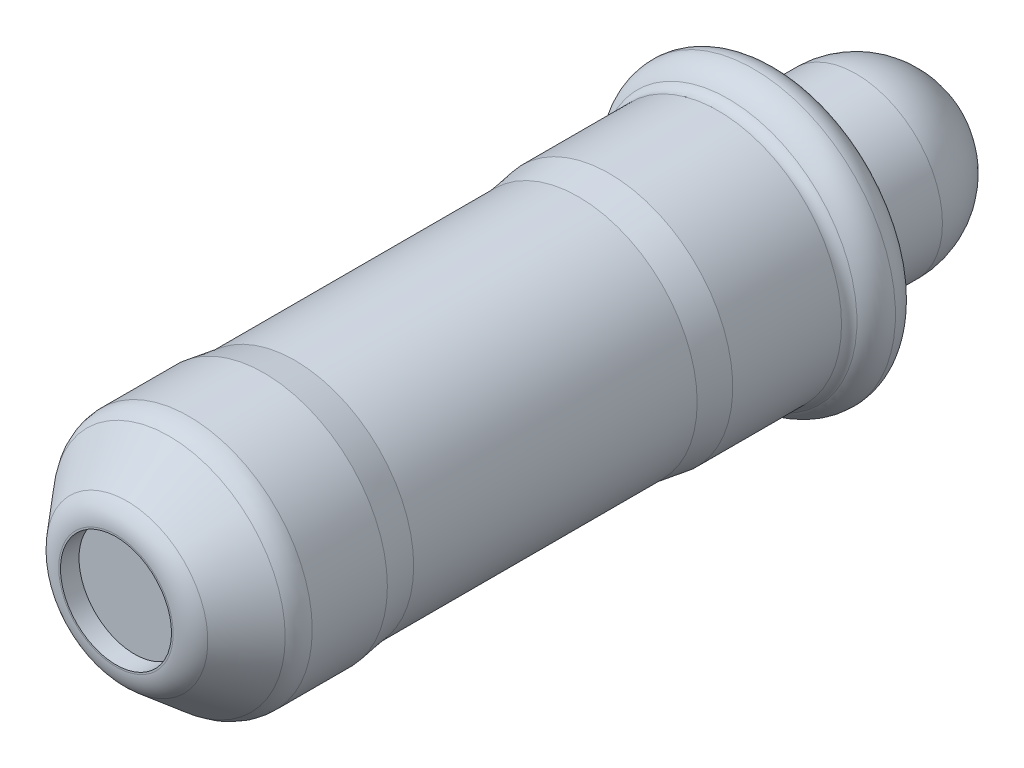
ISO-10303-21;
HEADER;
FILE_DESCRIPTION(('STEP AP214'),'2;1');
FILE_NAME('part.step','',(''),(''),'','','');
FILE_SCHEMA(('AUTOMOTIVE_DESIGN { 1 0 10303 214 1 1 1 1 }'));
ENDSEC;
DATA;
#1=APPLICATION_CONTEXT('core data for automotive mechanical design processes');
#2=APPLICATION_PROTOCOL_DEFINITION('international standard','automotive_design',2000,#1);
#3=PRODUCT_CONTEXT('',#1,'mechanical');
#4=PRODUCT('Part','Part','',(#3));
#5=PRODUCT_RELATED_PRODUCT_CATEGORY('part','',(#4));
#6=PRODUCT_DEFINITION_FORMATION('','',#4);
#7=PRODUCT_DEFINITION_CONTEXT('part definition',#1,'design');
#8=PRODUCT_DEFINITION('design','',#6,#7);
#9=PRODUCT_DEFINITION_SHAPE('','',#8);
#10=(LENGTH_UNIT() NAMED_UNIT(*) SI_UNIT(.MILLI.,.METRE.));
#11=(NAMED_UNIT(*) PLANE_ANGLE_UNIT() SI_UNIT($,.RADIAN.));
#12=(NAMED_UNIT(*) SI_UNIT($,.STERADIAN.) SOLID_ANGLE_UNIT());
#13=UNCERTAINTY_MEASURE_WITH_UNIT(LENGTH_MEASURE(1.E-05),#10,'distance_accuracy_value','');
#14=(GEOMETRIC_REPRESENTATION_CONTEXT(3) GLOBAL_UNCERTAINTY_ASSIGNED_CONTEXT((#13)) GLOBAL_UNIT_ASSIGNED_CONTEXT((#10,
#11,#12)) REPRESENTATION_CONTEXT('',''));
#15=CARTESIAN_POINT('',(0.,0.,0.));
#16=DIRECTION('',(0.,0.,1.));
#17=DIRECTION('',(1.,0.,0.));
#18=AXIS2_PLACEMENT_3D('',#15,#16,#17);
#19=CARTESIAN_POINT('',(0.,0.,2.7));
#20=DIRECTION('',(0.,0.,1.));
#21=DIRECTION('',(1.,0.,0.));
#22=AXIS2_PLACEMENT_3D('',#19,#20,#21);
#23=CYLINDRICAL_SURFACE('',#22,0.9);
#24=CARTESIAN_POINT('',(0.,0.,13.4));
#25=DIRECTION('',(0.,0.,1.));
#26=DIRECTION('',(1.,0.,0.));
#27=AXIS2_PLACEMENT_3D('',#24,#25,#26);
#28=CIRCLE('',#27,0.9);
#29=CARTESIAN_POINT('',(0.9,0.,13.4));
#30=VERTEX_POINT('',#29);
#31=EDGE_CURVE('E154',#30,#30,#28,.F.);
#32=ORIENTED_EDGE('',*,*,#31,.F.);
#33=EDGE_LOOP('',(#32));
#34=FACE_BOUND('',#33,.T.);
#35=CARTESIAN_POINT('',(0.,0.,13.1));
#36=DIRECTION('',(0.,0.,1.));
#37=DIRECTION('',(1.,0.,0.));
#38=AXIS2_PLACEMENT_3D('',#35,#36,#37);
#39=CIRCLE('',#38,0.9);
#40=CARTESIAN_POINT('',(0.9,0.,13.1));
#41=VERTEX_POINT('',#40);
#42=EDGE_CURVE('E161',#41,#41,#39,.T.);
#43=ORIENTED_EDGE('',*,*,#42,.F.);
#44=EDGE_LOOP('',(#43));
#45=FACE_BOUND('',#44,.T.);
#46=ADVANCED_FACE('F12',(#34,#45),#23,.F.);
#47=CARTESIAN_POINT('',(0.,1.39,2.7));
#48=DIRECTION('',(0.,0.,-1.));
#49=DIRECTION('',(-1.,0.,0.));
#50=AXIS2_PLACEMENT_3D('',#47,#48,#49);
#51=PLANE('',#50);
#52=CARTESIAN_POINT('',(0.,0.,2.7));
#53=DIRECTION('',(0.,0.,-1.));
#54=DIRECTION('',(-1.,0.,0.));
#55=AXIS2_PLACEMENT_3D('',#52,#53,#54);
#56=CIRCLE('',#55,1.4);
#57=CARTESIAN_POINT('',(-1.4,0.,2.7));
#58=VERTEX_POINT('',#57);
#59=EDGE_CURVE('E15',#58,#58,#56,.F.);
#60=ORIENTED_EDGE('',*,*,#59,.T.);
#61=EDGE_LOOP('',(#60));
#62=FACE_BOUND('',#61,.T.);
#63=CARTESIAN_POINT('',(0.,0.,2.70000000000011));
#64=DIRECTION('',(0.,0.,1.));
#65=DIRECTION('',(-1.,0.,0.));
#66=AXIS2_PLACEMENT_3D('',#63,#64,#65);
#67=CIRCLE('',#66,2.03326654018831);
#68=CARTESIAN_POINT('',(-2.03326654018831,0.,2.70000000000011));
#69=VERTEX_POINT('',#68);
#70=EDGE_CURVE('E150',#69,#69,#67,.T.);
#71=ORIENTED_EDGE('',*,*,#70,.F.);
#72=EDGE_LOOP('',(#71));
#73=FACE_BOUND('',#72,.T.);
#74=ADVANCED_FACE('F132',(#62,#73),#51,.T.);
#75=CARTESIAN_POINT('',(0.,0.927746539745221,13.4));
#76=DIRECTION('',(0.,0.,1.));
#77=DIRECTION('',(1.,0.,0.));
#78=AXIS2_PLACEMENT_3D('',#75,#76,#77);
#79=PLANE('',#78);
#80=CARTESIAN_POINT('',(0.,0.,13.4));
#81=DIRECTION('',(0.,0.,-1.));
#82=DIRECTION('',(-1.,0.,0.));
#83=AXIS2_PLACEMENT_3D('',#80,#81,#82);
#84=CIRCLE('',#83,0.927746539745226);
#85=CARTESIAN_POINT('',(-0.927746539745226,0.,13.4));
#86=VERTEX_POINT('',#85);
#87=EDGE_CURVE('E120',#86,#86,#84,.T.);
#88=ORIENTED_EDGE('',*,*,#87,.F.);
#89=EDGE_LOOP('',(#88));
#90=FACE_BOUND('',#89,.T.);
#91=ORIENTED_EDGE('',*,*,#31,.T.);
#92=EDGE_LOOP('',(#91));
#93=FACE_BOUND('',#92,.T.);
#94=ADVANCED_FACE('F124',(#90,#93),#79,.T.);
#95=CARTESIAN_POINT('',(0.,0.,2.9));
#96=DIRECTION('',(0.,0.,-1.));
#97=DIRECTION('',(-1.,0.,0.));
#98=AXIS2_PLACEMENT_3D('',#95,#96,#97);
#99=TOROIDAL_SURFACE('',#98,2.03326671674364,0.199999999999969);
#100=ORIENTED_EDGE('',*,*,#70,.T.);
#101=EDGE_LOOP('',(#100));
#102=FACE_BOUND('',#101,.T.);
#103=CARTESIAN_POINT('',(0.,0.,2.7589999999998));
#104=DIRECTION('',(0.,0.,-1.));
#105=DIRECTION('',(-1.,0.,0.));
#106=AXIS2_PLACEMENT_3D('',#103,#104,#105);
#107=CIRCLE('',#106,2.17510817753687);
#108=CARTESIAN_POINT('',(-2.17510817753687,0.,2.7589999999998));
#109=VERTEX_POINT('',#108);
#110=EDGE_CURVE('E89',#109,#109,#107,.F.);
#111=ORIENTED_EDGE('',*,*,#110,.F.);
#112=EDGE_LOOP('',(#111));
#113=FACE_BOUND('',#112,.T.);
#114=ADVANCED_FACE('F106',(#102,#113),#99,.T.);
#115=CARTESIAN_POINT('',(0.,0.,12.9));
#116=DIRECTION('',(0.,0.,-1.));
#117=DIRECTION('',(-1.,0.,0.));
#118=AXIS2_PLACEMENT_3D('',#115,#116,#117);
#119=TOROIDAL_SURFACE('',#118,0.927746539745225,0.5);
#120=CARTESIAN_POINT('',(0.,0.,13.2213938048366));
#121=DIRECTION('',(0.,0.,-1.));
#122=DIRECTION('',(-1.,0.,0.));
#123=AXIS2_PLACEMENT_3D('',#120,#121,#122);
#124=CIRCLE('',#123,1.31076876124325);
#125=CARTESIAN_POINT('',(-1.31076876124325,0.,13.2213938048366));
#126=VERTEX_POINT('',#125);
#127=EDGE_CURVE('E84',#126,#126,#124,.T.);
#128=ORIENTED_EDGE('',*,*,#127,.F.);
#129=EDGE_LOOP('',(#128));
#130=FACE_BOUND('',#129,.T.);
#131=ORIENTED_EDGE('',*,*,#87,.T.);
#132=EDGE_LOOP('',(#131));
#133=FACE_BOUND('',#132,.T.);
#134=ADVANCED_FACE('F100',(#130,#133),#119,.T.);
#135=CARTESIAN_POINT('',(0.,0.,3.062));
#136=DIRECTION('',(0.,0.,-1.));
#137=DIRECTION('',(-1.,0.,0.));
#138=AXIS2_PLACEMENT_3D('',#135,#136,#137);
#139=TOROIDAL_SURFACE('',#138,1.87,0.43);
#140=ORIENTED_EDGE('',*,*,#110,.T.);
#141=EDGE_LOOP('',(#140));
#142=FACE_BOUND('',#141,.T.);
#143=CARTESIAN_POINT('',(0.,0.,3.062));
#144=DIRECTION('',(0.,0.,-1.));
#145=DIRECTION('',(-1.,0.,0.));
#146=AXIS2_PLACEMENT_3D('',#143,#144,#145);
#147=CIRCLE('',#146,2.3);
#148=CARTESIAN_POINT('',(-2.3,0.,3.062));
#149=VERTEX_POINT('',#148);
#150=EDGE_CURVE('E78',#149,#149,#147,.F.);
#151=ORIENTED_EDGE('',*,*,#150,.F.);
#152=EDGE_LOOP('',(#151));
#153=FACE_BOUND('',#152,.T.);
#154=ADVANCED_FACE('F96',(#142,#153),#139,.T.);
#155=CARTESIAN_POINT('',(0.,0.,12.5394086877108));
#156=DIRECTION('',(0.,0.,-1.));
#157=DIRECTION('',(0.,1.,0.));
#158=AXIS2_PLACEMENT_3D('',#155,#156,#157);
#159=CONICAL_SURFACE('',#158,1.88302222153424,0.698131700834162);
#160=CARTESIAN_POINT('',(0.,0.,12.5394086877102));
#161=DIRECTION('',(0.,0.,-1.));
#162=DIRECTION('',(-1.,0.,0.));
#163=AXIS2_PLACEMENT_3D('',#160,#161,#162);
#164=CIRCLE('',#163,1.88302222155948);
#165=CARTESIAN_POINT('',(-1.88302222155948,0.,12.5394086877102));
#166=VERTEX_POINT('',#165);
#167=EDGE_CURVE('E75',#166,#166,#164,.T.);
#168=ORIENTED_EDGE('',*,*,#167,.F.);
#169=EDGE_LOOP('',(#168));
#170=FACE_BOUND('',#169,.T.);
#171=ORIENTED_EDGE('',*,*,#127,.T.);
#172=EDGE_LOOP('',(#171));
#173=FACE_BOUND('',#172,.T.);
#174=ADVANCED_FACE('F99',(#170,#173),#159,.T.);
#175=CARTESIAN_POINT('',(0.,0.,3.062));
#176=DIRECTION('',(0.,0.,-1.));
#177=DIRECTION('',(-1.,0.,0.));
#178=AXIS2_PLACEMENT_3D('',#175,#176,#177);
#179=TOROIDAL_SURFACE('',#178,1.8,0.500000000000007);
#180=ORIENTED_EDGE('',*,*,#150,.T.);
#181=EDGE_LOOP('',(#180));
#182=FACE_BOUND('',#181,.T.);
#183=CARTESIAN_POINT('',(0.,0.,3.47232590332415));
#184=DIRECTION('',(0.,0.,-1.));
#185=DIRECTION('',(-1.,0.,0.));
#186=AXIS2_PLACEMENT_3D('',#183,#184,#185);
#187=CIRCLE('',#186,2.08571428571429);
#188=CARTESIAN_POINT('',(-2.08571428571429,0.,3.47232590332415));
#189=VERTEX_POINT('',#188);
#190=EDGE_CURVE('E50',#189,#189,#187,.T.);
#191=ORIENTED_EDGE('',*,*,#190,.T.);
#192=EDGE_LOOP('',(#191));
#193=FACE_BOUND('',#192,.T.);
#194=ADVANCED_FACE('F68',(#182,#193),#179,.T.);
#195=CARTESIAN_POINT('',(0.,0.,12.2180148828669));
#196=DIRECTION('',(0.,0.,-1.));
#197=DIRECTION('',(-1.,0.,0.));
#198=AXIS2_PLACEMENT_3D('',#195,#196,#197);
#199=TOROIDAL_SURFACE('',#198,1.5,0.5);
#200=CARTESIAN_POINT('',(0.,0.,12.2180148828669));
#201=DIRECTION('',(0.,0.,1.));
#202=DIRECTION('',(1.,0.,0.));
#203=AXIS2_PLACEMENT_3D('',#200,#201,#202);
#204=CIRCLE('',#203,2.);
#205=CARTESIAN_POINT('',(2.,0.,12.2180148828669));
#206=VERTEX_POINT('',#205);
#207=EDGE_CURVE('E45',#206,#206,#204,.F.);
#208=ORIENTED_EDGE('',*,*,#207,.F.);
#209=EDGE_LOOP('',(#208));
#210=FACE_BOUND('',#209,.T.);
#211=ORIENTED_EDGE('',*,*,#167,.T.);
#212=EDGE_LOOP('',(#211));
#213=FACE_BOUND('',#212,.T.);
#214=ADVANCED_FACE('F62',(#210,#213),#199,.T.);
#215=CARTESIAN_POINT('',(0.,0.,3.6364562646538));
#216=DIRECTION('',(0.,0.,-1.));
#217=DIRECTION('',(-1.,0.,0.));
#218=AXIS2_PLACEMENT_3D('',#215,#216,#217);
#219=TOROIDAL_SURFACE('',#218,2.2,0.199999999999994);
#220=CARTESIAN_POINT('',(0.,0.,3.6364562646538));
#221=DIRECTION('',(0.,0.,1.));
#222=DIRECTION('',(1.,0.,0.));
#223=AXIS2_PLACEMENT_3D('',#220,#221,#222);
#224=CIRCLE('',#223,2.);
#225=CARTESIAN_POINT('',(2.,0.,3.6364562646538));
#226=VERTEX_POINT('',#225);
#227=EDGE_CURVE('E40',#226,#226,#224,.T.);
#228=ORIENTED_EDGE('',*,*,#227,.F.);
#229=EDGE_LOOP('',(#228));
#230=FACE_BOUND('',#229,.T.);
#231=ORIENTED_EDGE('',*,*,#190,.F.);
#232=EDGE_LOOP('',(#231));
#233=FACE_BOUND('',#232,.T.);
#234=ADVANCED_FACE('F57',(#230,#233),#219,.F.);
#235=CARTESIAN_POINT('',(0.,0.,2.7));
#236=DIRECTION('',(0.,0.,1.));
#237=DIRECTION('',(1.,0.,0.));
#238=AXIS2_PLACEMENT_3D('',#235,#236,#237);
#239=CYLINDRICAL_SURFACE('',#238,2.);
#240=CARTESIAN_POINT('',(0.,0.,10.9999999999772));
#241=DIRECTION('',(0.,0.,1.));
#242=DIRECTION('',(1.,0.,0.));
#243=AXIS2_PLACEMENT_3D('',#240,#241,#242);
#244=CIRCLE('',#243,1.99999999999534);
#245=CARTESIAN_POINT('',(1.99999999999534,0.,10.9999999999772));
#246=VERTEX_POINT('',#245);
#247=EDGE_CURVE('E35',#246,#246,#244,.F.);
#248=ORIENTED_EDGE('',*,*,#247,.F.);
#249=EDGE_LOOP('',(#248));
#250=FACE_BOUND('',#249,.T.);
#251=ORIENTED_EDGE('',*,*,#207,.T.);
#252=EDGE_LOOP('',(#251));
#253=FACE_BOUND('',#252,.T.);
#254=ADVANCED_FACE('F61',(#250,#253),#239,.T.);
#255=CARTESIAN_POINT('',(0.,0.,2.7));
#256=DIRECTION('',(0.,0.,1.));
#257=DIRECTION('',(1.,0.,0.));
#258=AXIS2_PLACEMENT_3D('',#255,#256,#257);
#259=CYLINDRICAL_SURFACE('',#258,2.);
#260=ORIENTED_EDGE('',*,*,#227,.T.);
#261=EDGE_LOOP('',(#260));
#262=FACE_BOUND('',#261,.T.);
#263=CARTESIAN_POINT('',(0.,0.,5.40000000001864));
#264=DIRECTION('',(0.,0.,-1.));
#265=DIRECTION('',(-1.,0.,0.));
#266=AXIS2_PLACEMENT_3D('',#263,#264,#265);
#267=CIRCLE('',#266,1.99999999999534);
#268=CARTESIAN_POINT('',(-1.99999999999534,0.,5.40000000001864));
#269=VERTEX_POINT('',#268);
#270=EDGE_CURVE('E24',#269,#269,#267,.F.);
#271=ORIENTED_EDGE('',*,*,#270,.F.);
#272=EDGE_LOOP('',(#271));
#273=FACE_BOUND('',#272,.T.);
#274=ADVANCED_FACE('F197',(#262,#273),#259,.T.);
#275=CARTESIAN_POINT('',(0.,0.,10.9999999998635));
#276=DIRECTION('',(0.,0.,1.));
#277=DIRECTION('',(1.,0.,0.));
#278=AXIS2_PLACEMENT_3D('',#275,#276,#277);
#279=CONICAL_SURFACE('',#278,1.99999999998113,0.148352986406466);
#280=CARTESIAN_POINT('',(0.,0.,10.4981632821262));
#281=DIRECTION('',(0.,0.,1.));
#282=DIRECTION('',(1.,0.,0.));
#283=AXIS2_PLACEMENT_3D('',#280,#281,#282);
#284=CIRCLE('',#283,1.925);
#285=CARTESIAN_POINT('',(1.925,0.,10.4981632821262));
#286=VERTEX_POINT('',#285);
#287=EDGE_CURVE('E19',#286,#286,#284,.F.);
#288=ORIENTED_EDGE('',*,*,#287,.F.);
#289=EDGE_LOOP('',(#288));
#290=FACE_BOUND('',#289,.T.);
#291=ORIENTED_EDGE('',*,*,#247,.T.);
#292=EDGE_LOOP('',(#291));
#293=FACE_BOUND('',#292,.T.);
#294=ADVANCED_FACE('F191',(#290,#293),#279,.T.);
#295=CARTESIAN_POINT('',(0.,0.,5.40000000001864));
#296=DIRECTION('',(0.,0.,-1.));
#297=DIRECTION('',(-1.,0.,0.));
#298=AXIS2_PLACEMENT_3D('',#295,#296,#297);
#299=CONICAL_SURFACE('',#298,1.99999999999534,0.148352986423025);
#300=ORIENTED_EDGE('',*,*,#270,.T.);
#301=EDGE_LOOP('',(#300));
#302=FACE_BOUND('',#301,.T.);
#303=CARTESIAN_POINT('',(0.,0.,5.90183671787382));
#304=DIRECTION('',(0.,0.,1.));
#305=DIRECTION('',(1.,0.,0.));
#306=AXIS2_PLACEMENT_3D('',#303,#304,#305);
#307=CIRCLE('',#306,1.925);
#308=CARTESIAN_POINT('',(1.925,0.,5.90183671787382));
#309=VERTEX_POINT('',#308);
#310=EDGE_CURVE('E8',#309,#309,#307,.T.);
#311=ORIENTED_EDGE('',*,*,#310,.F.);
#312=EDGE_LOOP('',(#311));
#313=FACE_BOUND('',#312,.T.);
#314=ADVANCED_FACE('F186',(#302,#313),#299,.T.);
#315=CARTESIAN_POINT('',(0.,0.,2.7));
#316=DIRECTION('',(0.,0.,1.));
#317=DIRECTION('',(1.,0.,0.));
#318=AXIS2_PLACEMENT_3D('',#315,#316,#317);
#319=CYLINDRICAL_SURFACE('',#318,1.925);
#320=ORIENTED_EDGE('',*,*,#310,.T.);
#321=EDGE_LOOP('',(#320));
#322=FACE_BOUND('',#321,.T.);
#323=ORIENTED_EDGE('',*,*,#287,.T.);
#324=EDGE_LOOP('',(#323));
#325=FACE_BOUND('',#324,.T.);
#326=ADVANCED_FACE('F183',(#322,#325),#319,.T.);
#327=CARTESIAN_POINT('',(0.,0.,13.1));
#328=DIRECTION('',(0.,0.,-1.));
#329=DIRECTION('',(-1.,0.,0.));
#330=AXIS2_PLACEMENT_3D('',#327,#328,#329);
#331=PLANE('',#330);
#332=ORIENTED_EDGE('',*,*,#42,.T.);
#333=EDGE_LOOP('',(#332));
#334=FACE_BOUND('',#333,.T.);
#335=ADVANCED_FACE('F174',(#334),#331,.F.);
#336=CARTESIAN_POINT('',(0.,0.,1.4));
#337=DIRECTION('',(0.,0.,1.));
#338=DIRECTION('',(-1.,0.,0.));
#339=AXIS2_PLACEMENT_3D('',#336,#337,#338);
#340=SPHERICAL_SURFACE('',#339,1.4);
#341=CARTESIAN_POINT('',(0.,0.,1.4));
#342=DIRECTION('',(0.,0.,1.));
#343=DIRECTION('',(1.,0.,0.));
#344=AXIS2_PLACEMENT_3D('',#341,#342,#343);
#345=CIRCLE('',#344,1.4);
#346=CARTESIAN_POINT('',(1.4,0.,1.4));
#347=VERTEX_POINT('',#346);
#348=EDGE_CURVE('E28',#347,#347,#345,.T.);
#349=ORIENTED_EDGE('',*,*,#348,.F.);
#350=EDGE_LOOP('',(#349));
#351=FACE_BOUND('',#350,.T.);
#352=ADVANCED_FACE('F172',(#351),#340,.T.);
#353=CARTESIAN_POINT('',(0.,0.,14.2494161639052));
#354=DIRECTION('',(0.,0.,1.));
#355=DIRECTION('',(1.,0.,0.));
#356=AXIS2_PLACEMENT_3D('',#353,#354,#355);
#357=CYLINDRICAL_SURFACE('',#356,1.4);
#358=ORIENTED_EDGE('',*,*,#59,.F.);
#359=EDGE_LOOP('',(#358));
#360=FACE_BOUND('',#359,.T.);
#361=ORIENTED_EDGE('',*,*,#348,.T.);
#362=EDGE_LOOP('',(#361));
#363=FACE_BOUND('',#362,.T.);
#364=ADVANCED_FACE('F170',(#360,#363),#357,.T.);
#365=CLOSED_SHELL('',(#46,#74,#94,#114,#134,#154,#174,#194,#214,#234,#254,#274,#294,#314,#326,
#335,#352,#364));
#366=MANIFOLD_SOLID_BREP('B1',#365);
#367=ADVANCED_BREP_SHAPE_REPRESENTATION('',(#18,#366),#14);
#368=SHAPE_DEFINITION_REPRESENTATION(#9,#367);
ENDSEC;
END-ISO-10303-21;
